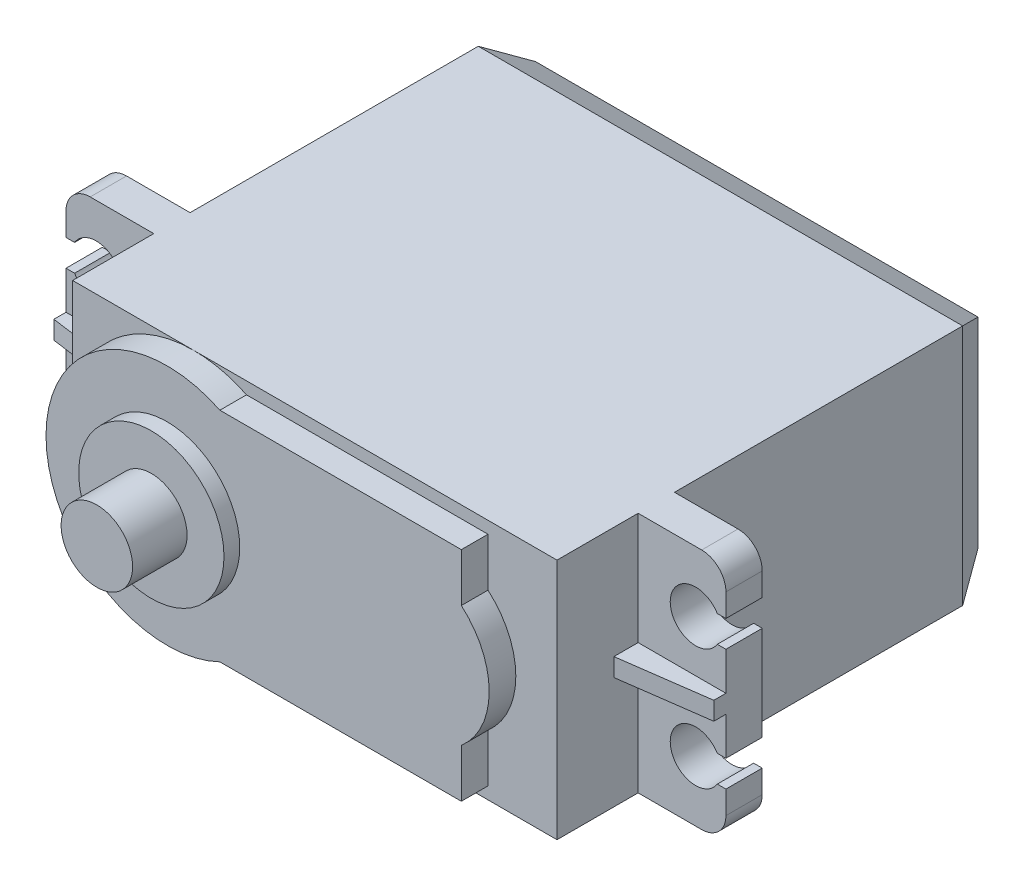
from build123d import *
from OCP.BRepFilletAPI import BRepFilletAPI_MakeChamfer

# Parameters (mm, degrees)
ESQUISSE1_W             = 40
ESQUISSE1_H             = 20
BOSS_EXTRU_1_DEPTH      = 36.5
BOSS_EXTRU_2_DEPTH      = 3
CONG_1_R                = 2
BOSS_EXTRU_3_DEPTH      = 0.75
BOSS_EXTRU_3_DEPTH_BACK = 0.75
CHANFREIN1_SIZE         = 3
CHANFREIN1_SIZE2        = 1.732050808
BOSS_EXTRU_4_DEPTH      = 2.2
ESQUISSE6_R             = 6
BOSS_EXTRU_5_DEPTH      = 1.3
ESQUISSE7_R             = 2.95
BOSS_EXTRU_6_DEPTH      = 4.5


with BuildPart() as part:
    # Esquisse1 → Boss.-Extru.1 (new body)
    with BuildSketch(Plane.XY):
        Rectangle(ESQUISSE1_W, ESQUISSE1_H)
    extrude(amount=BOSS_EXTRU_1_DEPTH)

    # Esquisse2 → Boss.-Extru.2 (add)
    with BuildSketch(Plane(origin=(0, 0, 26.8), x_dir=(-1, 0, 0), z_dir=(0, 0, -1))):
        with BuildLine():
            Line((-20, 10), (-27.25, 10))
            Line((-27.25, 10), (-27.25, 6.1))
            Line((-27.25, 6.1), (-26.538854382, 6.1))
            ThreePointArc((-26.538854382, 6.1), (-22.65, 5), (-26.538854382, 3.9))
            Line((-26.538854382, 3.9), (-27.25, 3.9))
            Line((-27.25, 3.9), (-27.25, -3.9))
            Line((-27.25, -3.9), (-26.538854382, -3.9))
            ThreePointArc((-26.538854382, -3.9), (-22.65, -5), (-26.538854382, -6.1))
            Line((-26.538854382, -6.1), (-27.25, -6.1))
            Line((-27.25, -6.1), (-27.25, -10))
            Line((-27.25, -10), (-20, -10))
            Line((-20, -10), (-20, 10))
        make_face()
        with BuildLine():
            Line((20, -10), (27.25, -10))
            Line((27.25, -10), (27.25, -6.1))
            Line((27.25, -6.1), (26.538854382, -6.1))
            ThreePointArc((26.538854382, -6.1), (22.65, -5), (26.538854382, -3.9))
            Line((26.538854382, -3.9), (27.25, -3.9))
            Line((27.25, -3.9), (27.25, 3.9))
            Line((27.25, 3.9), (26.538854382, 3.9))
            ThreePointArc((26.538854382, 3.9), (22.65, 5), (26.538854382, 6.1))
            Line((26.538854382, 6.1), (27.25, 6.1))
            Line((27.25, 6.1), (27.25, 10))
            Line((27.25, 10), (20, 10))
            Line((20, 10), (20, -10))
        make_face()
    extrude(amount=-BOSS_EXTRU_2_DEPTH)

    # Cong_1
    cong_1_edges = [part.edges().sort_by_distance(p)[0] for p in [
        (-27.25, 10, 28.3),
        (27.25, 10, 28.3),
        (-27.25, -10, 28.3),
        (27.25, -10, 28.3),
    ]]
    fillet(cong_1_edges, radius=CONG_1_R)

    # Esquisse3 → Boss.-Extru.3 (add, two sides: drawn at the far end of the back side and taken through both)
    with BuildSketch(Plane(origin=(0, 0, 0), x_dir=(1, 0, 0), z_dir=(0, 1, 0)).offset(-BOSS_EXTRU_3_DEPTH_BACK)):
        Polygon((-27.25, -29.8), (-27.25, -30.8), (-20, -31.8), (-20, -29.8), align=None)
        Polygon((27.25, -30.8), (20, -31.8), (20, -29.8), (27.25, -29.8), align=None)
    extrude(amount=BOSS_EXTRU_3_DEPTH + BOSS_EXTRU_3_DEPTH_BACK)

    # Chanfrein1: one chamfer whose edges measure the first distance from different faces: ONE call of the kernel's chamfer builder (chamfer() names one face for all edges)
    chanfrein1_edges_1 = [part.edges().sort_by_distance(p)[0] for p in [
        (0, 10, 0),
    ]]
    chanfrein1_side_1 = [part.faces().sort_by_distance(p)[0] for p in [
        (0, 10, 18.462252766),
    ]]
    chanfrein1_edges_2 = [part.edges().sort_by_distance(p)[0] for p in [
        (20, 0, 0),
    ]]
    chanfrein1_side_2 = [part.faces().sort_by_distance(p)[0] for p in [
        (20, 0, 13.4),
    ]]
    chanfrein1_edges_3 = [part.edges().sort_by_distance(p)[0] for p in [
        (0, -10, 0),
    ]]
    chanfrein1_side_3 = [part.faces().sort_by_distance(p)[0] for p in [
        (0, -10, 18.462252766),
    ]]
    chanfrein1_edges_4 = [part.edges().sort_by_distance(p)[0] for p in [
        (-20, 0, 0),
    ]]
    chanfrein1_side_4 = [part.faces().sort_by_distance(p)[0] for p in [
        (-20, 0, 13.4),
    ]]
    chanfrein1 = BRepFilletAPI_MakeChamfer(part.part.solid().wrapped)
    for e in chanfrein1_edges_1:
        chanfrein1.Add(CHANFREIN1_SIZE, CHANFREIN1_SIZE2, e.wrapped, chanfrein1_side_1[0].wrapped)  # the first distance lies on this face
    for e in chanfrein1_edges_2:
        chanfrein1.Add(CHANFREIN1_SIZE, CHANFREIN1_SIZE2, e.wrapped, chanfrein1_side_2[0].wrapped)  # the first distance lies on this face
    for e in chanfrein1_edges_3:
        chanfrein1.Add(CHANFREIN1_SIZE, CHANFREIN1_SIZE2, e.wrapped, chanfrein1_side_3[0].wrapped)  # the first distance lies on this face
    for e in chanfrein1_edges_4:
        chanfrein1.Add(CHANFREIN1_SIZE, CHANFREIN1_SIZE2, e.wrapped, chanfrein1_side_4[0].wrapped)  # the first distance lies on this face
    add(Compound.cast(chanfrein1.Shape()), mode=Mode.REPLACE)

    # Esquisse4 → Boss.-Extru.4 (add)
    with BuildSketch(Plane.XY.offset(36.5)):
        with BuildLine():
            Line((-5.641101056, 9), (14.3, 9))
            Line((14.3, 9), (14.3, 5))
            ThreePointArc((14.3, 5), (16.6, 0), (14.3, -5))
            Line((14.3, -5), (14.3, -9))
            Line((14.3, -9), (-5.641101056, -9))
            ThreePointArc((-5.641101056, -9), (-20, 0), (-5.641101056, 9))
        make_face()
    extrude(amount=BOSS_EXTRU_4_DEPTH)

    # Esquisse6 → Boss.-Extru.5 (add)
    with BuildSketch(Plane.XY.offset(38.7)):
        with Locations((-10, 0)):
            Circle(ESQUISSE6_R)
    extrude(amount=BOSS_EXTRU_5_DEPTH)

    # Esquisse7 → Boss.-Extru.6 (add)
    with BuildSketch(Plane.XY.offset(40)):
        with Locations((-10, 0)):
            Circle(ESQUISSE7_R)
    extrude(amount=BOSS_EXTRU_6_DEPTH)


solid = part.part
